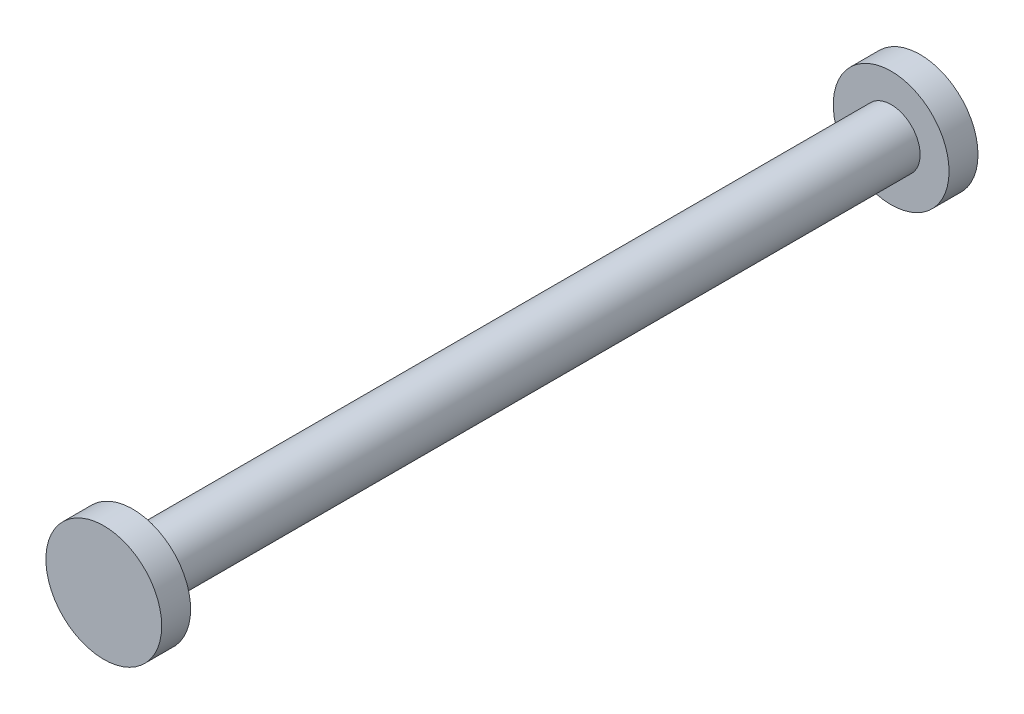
from build123d import *

# Parameters (mm, degrees)
SKETCH1_R           = 10
BOSS_EXTRUDE1_DEPTH = 5
SKETCH2_R           = 5
BOSS_EXTRUDE2_DEPTH = 131
SKETCH3_R           = 10
BOSS_EXTRUDE3_DEPTH = 5


with BuildPart() as part:
    # Sketch1 → Boss-Extrude1 (new body)
    with BuildSketch(Plane.XY):
        Circle(SKETCH1_R)
    extrude(amount=BOSS_EXTRUDE1_DEPTH)

    # Sketch2 → Boss-Extrude2 (add)
    with BuildSketch(Plane.XY.offset(5)):
        Circle(SKETCH2_R)
    extrude(amount=BOSS_EXTRUDE2_DEPTH)

    # Sketch3 → Boss-Extrude3 (add)
    with BuildSketch(Plane.XY.offset(136)):
        Circle(SKETCH3_R)
    extrude(amount=BOSS_EXTRUDE3_DEPTH)


solid = part.part
